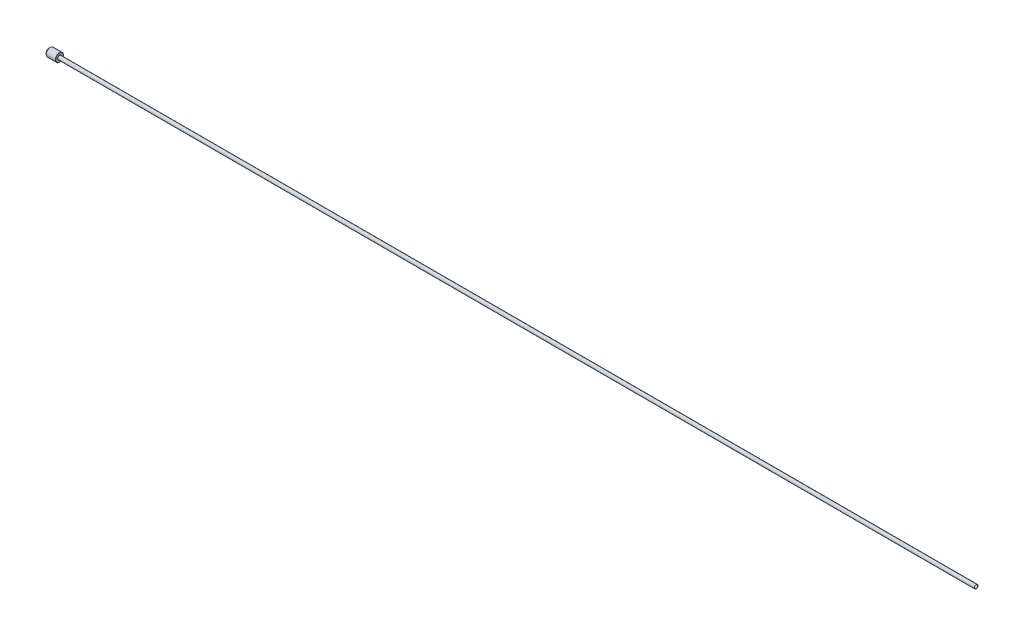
from build123d import *

# Parameters (mm, degrees)
FILLET1_R = 0.1


with BuildPart() as part:
    # Sketch1 → Revolve1 (revolve)
    with BuildSketch(Plane.XY, mode=Mode.PRIVATE) as revolve1_sk:
        Polygon((0.495, 2), (4, 2), (5, 2), (5, 0.9144), (450, 0.9144), (450, 0.762), (0, 0.762), (0, 1.605), (0.1, 1.605), align=None)
    revolve(revolve1_sk.sketch.rotate(Axis((-22.212185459, 0, 0), (1, 0, 0)), 90), axis=Axis((-22.212185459, 0, 0), (1, 0, 0)))

    # Fillet1
    fillet1_edges = [part.edges().sort_by_distance(p)[0] for p in [
        (5, 0, -2),
    ]]
    fillet(fillet1_edges, radius=FILLET1_R)


solid = part.part
